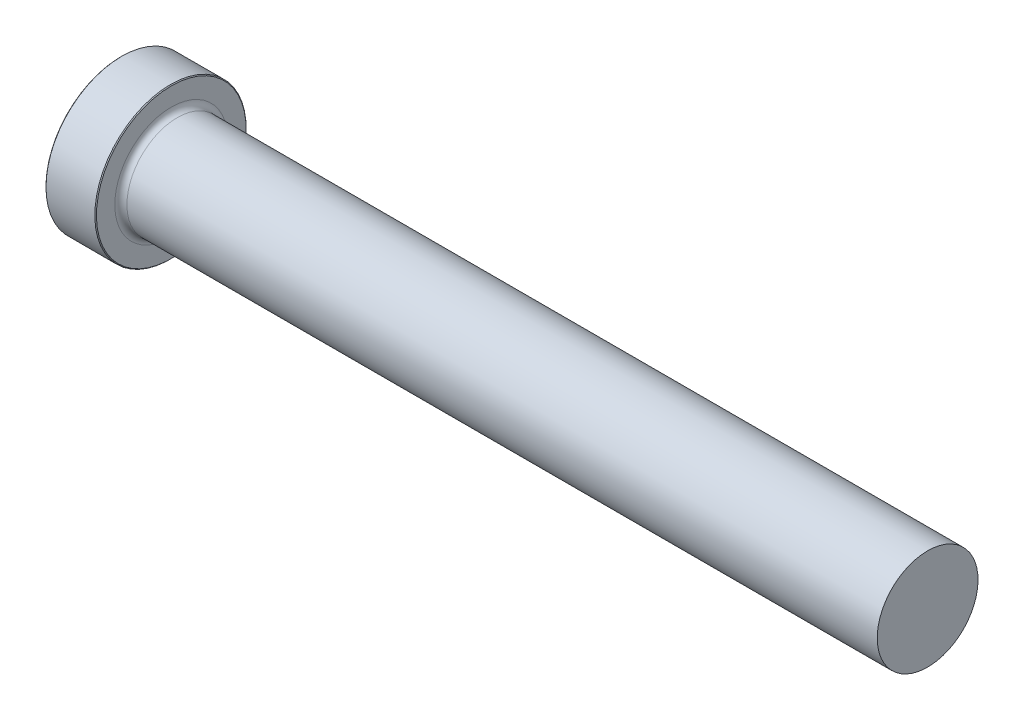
ISO-10303-21;
HEADER;
FILE_DESCRIPTION(('STEP AP214'),'2;1');
FILE_NAME('part.step','',(''),(''),'','','');
FILE_SCHEMA(('AUTOMOTIVE_DESIGN { 1 0 10303 214 1 1 1 1 }'));
ENDSEC;
DATA;
#1=APPLICATION_CONTEXT('core data for automotive mechanical design processes');
#2=APPLICATION_PROTOCOL_DEFINITION('international standard','automotive_design',2000,#1);
#3=PRODUCT_CONTEXT('',#1,'mechanical');
#4=PRODUCT('Part','Part','',(#3));
#5=PRODUCT_RELATED_PRODUCT_CATEGORY('part','',(#4));
#6=PRODUCT_DEFINITION_FORMATION('','',#4);
#7=PRODUCT_DEFINITION_CONTEXT('part definition',#1,'design');
#8=PRODUCT_DEFINITION('design','',#6,#7);
#9=PRODUCT_DEFINITION_SHAPE('','',#8);
#10=(LENGTH_UNIT() NAMED_UNIT(*) SI_UNIT(.MILLI.,.METRE.));
#11=(NAMED_UNIT(*) PLANE_ANGLE_UNIT() SI_UNIT($,.RADIAN.));
#12=(NAMED_UNIT(*) SI_UNIT($,.STERADIAN.) SOLID_ANGLE_UNIT());
#13=UNCERTAINTY_MEASURE_WITH_UNIT(LENGTH_MEASURE(1.E-05),#10,'distance_accuracy_value','');
#14=(GEOMETRIC_REPRESENTATION_CONTEXT(3) GLOBAL_UNCERTAINTY_ASSIGNED_CONTEXT((#13)) GLOBAL_UNIT_ASSIGNED_CONTEXT((#10,
#11,#12)) REPRESENTATION_CONTEXT('',''));
#15=CARTESIAN_POINT('',(0.,0.,0.));
#16=DIRECTION('',(0.,0.,1.));
#17=DIRECTION('',(1.,0.,0.));
#18=AXIS2_PLACEMENT_3D('',#15,#16,#17);
#19=CARTESIAN_POINT('',(101.6,6.34618999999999,0.));
#20=DIRECTION('',(1.,0.,0.));
#21=DIRECTION('',(0.,1.,0.));
#22=AXIS2_PLACEMENT_3D('',#19,#20,#21);
#23=PLANE('',#22);
#24=CARTESIAN_POINT('',(101.6,0.,0.));
#25=DIRECTION('',(1.,0.,0.));
#26=DIRECTION('',(0.,1.,0.));
#27=AXIS2_PLACEMENT_3D('',#24,#25,#26);
#28=CIRCLE('',#27,6.34619);
#29=CARTESIAN_POINT('',(101.6,6.34618999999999,0.));
#30=VERTEX_POINT('',#29);
#31=EDGE_CURVE('E50',#30,#30,#28,.T.);
#32=ORIENTED_EDGE('',*,*,#31,.T.);
#33=EDGE_LOOP('',(#32));
#34=FACE_BOUND('',#33,.T.);
#35=ADVANCED_FACE('F30',(#34),#23,.T.);
#36=CARTESIAN_POINT('',(101.6,0.,0.));
#37=DIRECTION('',(1.,0.,0.));
#38=DIRECTION('',(0.,1.,0.));
#39=AXIS2_PLACEMENT_3D('',#36,#37,#38);
#40=CYLINDRICAL_SURFACE('',#39,6.34619);
#41=CARTESIAN_POINT('',(7.11199999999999,0.,0.));
#42=DIRECTION('',(1.,0.,0.));
#43=DIRECTION('',(0.,1.,0.));
#44=AXIS2_PLACEMENT_3D('',#41,#42,#43);
#45=CIRCLE('',#44,6.34618999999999);
#46=CARTESIAN_POINT('',(7.11199999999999,6.34618999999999,0.));
#47=VERTEX_POINT('',#46);
#48=EDGE_CURVE('E53',#47,#47,#45,.T.);
#49=ORIENTED_EDGE('',*,*,#48,.T.);
#50=EDGE_LOOP('',(#49));
#51=FACE_BOUND('',#50,.T.);
#52=ORIENTED_EDGE('',*,*,#31,.F.);
#53=EDGE_LOOP('',(#52));
#54=FACE_BOUND('',#53,.T.);
#55=ADVANCED_FACE('F74',(#51,#54),#40,.T.);
#56=CARTESIAN_POINT('',(7.112,0.,0.));
#57=DIRECTION('',(1.,0.,0.));
#58=DIRECTION('',(0.,1.,0.));
#59=AXIS2_PLACEMENT_3D('',#56,#57,#58);
#60=TOROIDAL_SURFACE('',#59,7.10818999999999,0.761999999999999);
#61=CARTESIAN_POINT('',(6.34999999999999,0.,0.));
#62=DIRECTION('',(1.,0.,0.));
#63=DIRECTION('',(0.,1.,0.));
#64=AXIS2_PLACEMENT_3D('',#61,#62,#63);
#65=CIRCLE('',#64,7.10818999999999);
#66=CARTESIAN_POINT('',(6.35,7.10818999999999,0.));
#67=VERTEX_POINT('',#66);
#68=EDGE_CURVE('E56',#67,#67,#65,.T.);
#69=ORIENTED_EDGE('',*,*,#68,.T.);
#70=EDGE_LOOP('',(#69));
#71=FACE_BOUND('',#70,.T.);
#72=ORIENTED_EDGE('',*,*,#48,.F.);
#73=EDGE_LOOP('',(#72));
#74=FACE_BOUND('',#73,.T.);
#75=ADVANCED_FACE('F60',(#71,#74),#60,.F.);
#76=CARTESIAN_POINT('',(6.35,9.525,0.));
#77=DIRECTION('',(1.,0.,0.));
#78=DIRECTION('',(0.,1.,0.));
#79=AXIS2_PLACEMENT_3D('',#76,#77,#78);
#80=PLANE('',#79);
#81=CARTESIAN_POINT('',(6.35,0.,0.));
#82=DIRECTION('',(1.,0.,0.));
#83=DIRECTION('',(0.,1.,0.));
#84=AXIS2_PLACEMENT_3D('',#81,#82,#83);
#85=CIRCLE('',#84,9.42340000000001);
#86=CARTESIAN_POINT('',(6.35,9.42340000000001,0.));
#87=VERTEX_POINT('',#86);
#88=EDGE_CURVE('E10',#87,#87,#85,.T.);
#89=ORIENTED_EDGE('',*,*,#88,.T.);
#90=EDGE_LOOP('',(#89));
#91=FACE_BOUND('',#90,.T.);
#92=ORIENTED_EDGE('',*,*,#68,.F.);
#93=EDGE_LOOP('',(#92));
#94=FACE_BOUND('',#93,.T.);
#95=ADVANCED_FACE('F63',(#91,#94),#80,.T.);
#96=CARTESIAN_POINT('',(101.6,0.,0.));
#97=DIRECTION('',(1.,0.,0.));
#98=DIRECTION('',(0.,1.,0.));
#99=AXIS2_PLACEMENT_3D('',#96,#97,#98);
#100=CYLINDRICAL_SURFACE('',#99,9.525);
#101=CARTESIAN_POINT('',(0.101599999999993,0.,0.));
#102=DIRECTION('',(-1.,0.,0.));
#103=DIRECTION('',(0.,-1.,0.));
#104=AXIS2_PLACEMENT_3D('',#101,#102,#103);
#105=CIRCLE('',#104,9.525);
#106=CARTESIAN_POINT('',(0.101599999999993,-9.525,0.));
#107=VERTEX_POINT('',#106);
#108=EDGE_CURVE('E41',#107,#107,#105,.F.);
#109=ORIENTED_EDGE('',*,*,#108,.T.);
#110=EDGE_LOOP('',(#109));
#111=FACE_BOUND('',#110,.T.);
#112=CARTESIAN_POINT('',(6.24840000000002,0.,0.));
#113=DIRECTION('',(1.,0.,0.));
#114=DIRECTION('',(0.,1.,0.));
#115=AXIS2_PLACEMENT_3D('',#112,#113,#114);
#116=CIRCLE('',#115,9.525);
#117=CARTESIAN_POINT('',(6.24840000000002,9.525,0.));
#118=VERTEX_POINT('',#117);
#119=EDGE_CURVE('E45',#118,#118,#116,.F.);
#120=ORIENTED_EDGE('',*,*,#119,.T.);
#121=EDGE_LOOP('',(#120));
#122=FACE_BOUND('',#121,.T.);
#123=ADVANCED_FACE('F65',(#111,#122),#100,.T.);
#124=CARTESIAN_POINT('',(0.,0.,0.));
#125=DIRECTION('',(-1.,0.,0.));
#126=DIRECTION('',(0.,-1.,0.));
#127=AXIS2_PLACEMENT_3D('',#124,#125,#126);
#128=PLANE('',#127);
#129=CARTESIAN_POINT('',(0.,0.,0.));
#130=DIRECTION('',(-1.,0.,0.));
#131=DIRECTION('',(0.,-1.,0.));
#132=AXIS2_PLACEMENT_3D('',#129,#130,#131);
#133=CIRCLE('',#132,9.4234);
#134=CARTESIAN_POINT('',(0.,-9.4234,0.));
#135=VERTEX_POINT('',#134);
#136=EDGE_CURVE('E37',#135,#135,#133,.T.);
#137=ORIENTED_EDGE('',*,*,#136,.T.);
#138=EDGE_LOOP('',(#137));
#139=FACE_BOUND('',#138,.T.);
#140=ADVANCED_FACE('F71',(#139),#128,.T.);
#141=CARTESIAN_POINT('',(0.101599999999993,0.,0.));
#142=DIRECTION('',(1.,0.,0.));
#143=DIRECTION('',(0.,1.,0.));
#144=AXIS2_PLACEMENT_3D('',#141,#142,#143);
#145=CONICAL_SURFACE('',#144,9.525,0.785398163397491);
#146=ORIENTED_EDGE('',*,*,#136,.F.);
#147=EDGE_LOOP('',(#146));
#148=FACE_BOUND('',#147,.T.);
#149=ORIENTED_EDGE('',*,*,#108,.F.);
#150=EDGE_LOOP('',(#149));
#151=FACE_BOUND('',#150,.T.);
#152=ADVANCED_FACE('F84',(#148,#151),#145,.T.);
#153=CARTESIAN_POINT('',(6.34999999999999,0.,0.));
#154=DIRECTION('',(-1.,0.,0.));
#155=DIRECTION('',(0.,-1.,0.));
#156=AXIS2_PLACEMENT_3D('',#153,#154,#155);
#157=CONICAL_SURFACE('',#156,9.42340000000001,0.785398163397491);
#158=ORIENTED_EDGE('',*,*,#119,.F.);
#159=EDGE_LOOP('',(#158));
#160=FACE_BOUND('',#159,.T.);
#161=ORIENTED_EDGE('',*,*,#88,.F.);
#162=EDGE_LOOP('',(#161));
#163=FACE_BOUND('',#162,.T.);
#164=ADVANCED_FACE('F32',(#160,#163),#157,.T.);
#165=CLOSED_SHELL('',(#35,#55,#75,#95,#123,#140,#152,#164));
#166=MANIFOLD_SOLID_BREP('B2',#165);
#167=ADVANCED_BREP_SHAPE_REPRESENTATION('',(#18,#166),#14);
#168=SHAPE_DEFINITION_REPRESENTATION(#9,#167);
ENDSEC;
END-ISO-10303-21;
